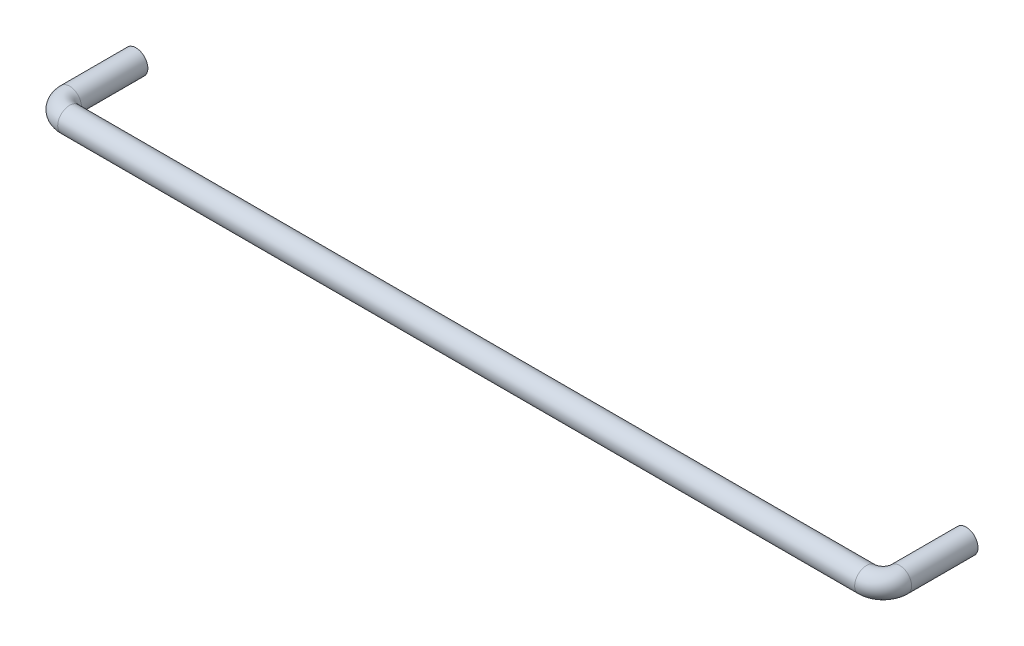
ISO-10303-21;
HEADER;
FILE_DESCRIPTION(('STEP AP214'),'2;1');
FILE_NAME('part.step','',(''),(''),'','','');
FILE_SCHEMA(('AUTOMOTIVE_DESIGN { 1 0 10303 214 1 1 1 1 }'));
ENDSEC;
DATA;
#1=APPLICATION_CONTEXT('core data for automotive mechanical design processes');
#2=APPLICATION_PROTOCOL_DEFINITION('international standard','automotive_design',2000,#1);
#3=PRODUCT_CONTEXT('',#1,'mechanical');
#4=PRODUCT('Part','Part','',(#3));
#5=PRODUCT_RELATED_PRODUCT_CATEGORY('part','',(#4));
#6=PRODUCT_DEFINITION_FORMATION('','',#4);
#7=PRODUCT_DEFINITION_CONTEXT('part definition',#1,'design');
#8=PRODUCT_DEFINITION('design','',#6,#7);
#9=PRODUCT_DEFINITION_SHAPE('','',#8);
#10=(LENGTH_UNIT() NAMED_UNIT(*) SI_UNIT(.MILLI.,.METRE.));
#11=(NAMED_UNIT(*) PLANE_ANGLE_UNIT() SI_UNIT($,.RADIAN.));
#12=(NAMED_UNIT(*) SI_UNIT($,.STERADIAN.) SOLID_ANGLE_UNIT());
#13=UNCERTAINTY_MEASURE_WITH_UNIT(LENGTH_MEASURE(1.E-05),#10,'distance_accuracy_value','');
#14=(GEOMETRIC_REPRESENTATION_CONTEXT(3) GLOBAL_UNCERTAINTY_ASSIGNED_CONTEXT((#13)) GLOBAL_UNIT_ASSIGNED_CONTEXT((#10,
#11,#12)) REPRESENTATION_CONTEXT('',''));
#15=CARTESIAN_POINT('',(0.,0.,0.));
#16=DIRECTION('',(0.,0.,1.));
#17=DIRECTION('',(1.,0.,0.));
#18=AXIS2_PLACEMENT_3D('',#15,#16,#17);
#19=CARTESIAN_POINT('',(0.,0.,0.));
#20=DIRECTION('',(0.,0.,1.));
#21=DIRECTION('',(0.,-1.,0.));
#22=AXIS2_PLACEMENT_3D('',#19,#20,#21);
#23=PLANE('',#22);
#24=CARTESIAN_POINT('',(0.,0.,0.));
#25=DIRECTION('',(0.,0.,1.));
#26=DIRECTION('',(1.,0.,0.));
#27=AXIS2_PLACEMENT_3D('',#24,#25,#26);
#28=CIRCLE('',#27,2.94999999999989);
#29=CARTESIAN_POINT('',(2.94999999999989,0.,0.));
#30=VERTEX_POINT('',#29);
#31=EDGE_CURVE('E8',#30,#30,#28,.T.);
#32=ORIENTED_EDGE('',*,*,#31,.T.);
#33=EDGE_LOOP('',(#32));
#34=FACE_BOUND('',#33,.T.);
#35=CARTESIAN_POINT('',(0.,0.,0.));
#36=DIRECTION('',(0.,0.,1.));
#37=DIRECTION('',(0.,-1.,0.));
#38=AXIS2_PLACEMENT_3D('',#35,#36,#37);
#39=CIRCLE('',#38,5.);
#40=CARTESIAN_POINT('',(0.,-5.,0.));
#41=VERTEX_POINT('',#40);
#42=EDGE_CURVE('E32',#41,#41,#39,.T.);
#43=ORIENTED_EDGE('',*,*,#42,.F.);
#44=EDGE_LOOP('',(#43));
#45=FACE_BOUND('',#44,.T.);
#46=ADVANCED_FACE('F12',(#34,#45),#23,.F.);
#47=CARTESIAN_POINT('',(350.,0.,4.9960036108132E-13));
#48=DIRECTION('',(0.,0.,-1.));
#49=DIRECTION('',(0.,-1.,0.));
#50=AXIS2_PLACEMENT_3D('',#47,#48,#49);
#51=PLANE('',#50);
#52=CARTESIAN_POINT('',(350.,0.,4.9960036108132E-13));
#53=DIRECTION('',(0.,0.,-1.));
#54=DIRECTION('',(-1.,0.,0.));
#55=AXIS2_PLACEMENT_3D('',#52,#53,#54);
#56=CIRCLE('',#55,2.94999999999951);
#57=CARTESIAN_POINT('',(347.05,0.,4.9960036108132E-13));
#58=VERTEX_POINT('',#57);
#59=EDGE_CURVE('E23',#58,#58,#56,.F.);
#60=ORIENTED_EDGE('',*,*,#59,.T.);
#61=EDGE_LOOP('',(#60));
#62=FACE_BOUND('',#61,.T.);
#63=CARTESIAN_POINT('',(350.,0.,4.9960036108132E-13));
#64=DIRECTION('',(0.,0.,-1.));
#65=DIRECTION('',(0.,-1.,0.));
#66=AXIS2_PLACEMENT_3D('',#63,#64,#65);
#67=CIRCLE('',#66,5.);
#68=CARTESIAN_POINT('',(350.,-5.,4.9960036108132E-13));
#69=VERTEX_POINT('',#68);
#70=EDGE_CURVE('E47',#69,#69,#67,.T.);
#71=ORIENTED_EDGE('',*,*,#70,.T.);
#72=EDGE_LOOP('',(#71));
#73=FACE_BOUND('',#72,.T.);
#74=ADVANCED_FACE('F75',(#62,#73),#51,.T.);
#75=CARTESIAN_POINT('',(0.,0.,28.));
#76=DIRECTION('',(0.,0.,-1.));
#77=DIRECTION('',(0.,-1.,0.));
#78=AXIS2_PLACEMENT_3D('',#75,#76,#77);
#79=CYLINDRICAL_SURFACE('',#78,5.);
#80=ORIENTED_EDGE('',*,*,#42,.T.);
#81=EDGE_LOOP('',(#80));
#82=FACE_BOUND('',#81,.T.);
#83=CARTESIAN_POINT('',(0.,0.,28.));
#84=DIRECTION('',(0.,0.,1.));
#85=DIRECTION('',(0.,-1.,0.));
#86=AXIS2_PLACEMENT_3D('',#83,#84,#85);
#87=CIRCLE('',#86,5.);
#88=CARTESIAN_POINT('',(-5.00000000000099,0.,28.));
#89=VERTEX_POINT('',#88);
#90=EDGE_CURVE('E35',#89,#89,#87,.T.);
#91=ORIENTED_EDGE('',*,*,#90,.F.);
#92=EDGE_LOOP('',(#91));
#93=FACE_BOUND('',#92,.T.);
#94=ADVANCED_FACE('F81',(#82,#93),#79,.T.);
#95=CARTESIAN_POINT('',(6.99999999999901,0.,28.));
#96=DIRECTION('',(0.,-1.,0.));
#97=DIRECTION('',(1.,0.,0.));
#98=AXIS2_PLACEMENT_3D('',#95,#96,#97);
#99=TOROIDAL_SURFACE('',#98,7.,5.);
#100=CARTESIAN_POINT('',(6.99999999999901,0.,35.));
#101=DIRECTION('',(1.,0.,0.));
#102=DIRECTION('',(0.,-1.,0.));
#103=AXIS2_PLACEMENT_3D('',#100,#101,#102);
#104=CIRCLE('',#103,5.);
#105=CARTESIAN_POINT('',(6.99999999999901,0.,40.));
#106=VERTEX_POINT('',#105);
#107=EDGE_CURVE('E38',#106,#106,#104,.T.);
#108=CARTESIAN_POINT('',(6.99999999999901,0.,28.));
#109=DIRECTION('',(0.,-1.,0.));
#110=DIRECTION('',(1.,0.,0.));
#111=AXIS2_PLACEMENT_3D('',#108,#109,#110);
#112=CIRCLE('',#111,12.);
#113=EDGE_CURVE('',#106,#89,#112,.T.);
#114=ORIENTED_EDGE('',*,*,#107,.F.);
#115=ORIENTED_EDGE('',*,*,#90,.T.);
#116=ORIENTED_EDGE('',*,*,#113,.T.);
#117=ORIENTED_EDGE('',*,*,#113,.F.);
#118=EDGE_LOOP('',(#114,#116,#115,#117));
#119=FACE_BOUND('',#118,.T.);
#120=ADVANCED_FACE('F98',(#119),#99,.T.);
#121=CARTESIAN_POINT('',(343.,0.,35.));
#122=DIRECTION('',(-1.,0.,0.));
#123=DIRECTION('',(0.,0.,1.));
#124=AXIS2_PLACEMENT_3D('',#121,#122,#123);
#125=CYLINDRICAL_SURFACE('',#124,5.);
#126=CARTESIAN_POINT('',(343.,0.,35.));
#127=DIRECTION('',(1.,0.,0.));
#128=DIRECTION('',(0.,-1.,0.));
#129=AXIS2_PLACEMENT_3D('',#126,#127,#128);
#130=CIRCLE('',#129,5.);
#131=CARTESIAN_POINT('',(343.,0.,40.));
#132=VERTEX_POINT('',#131);
#133=EDGE_CURVE('E41',#132,#132,#130,.T.);
#134=ORIENTED_EDGE('',*,*,#133,.F.);
#135=EDGE_LOOP('',(#134));
#136=FACE_BOUND('',#135,.T.);
#137=ORIENTED_EDGE('',*,*,#107,.T.);
#138=EDGE_LOOP('',(#137));
#139=FACE_BOUND('',#138,.T.);
#140=ADVANCED_FACE('F94',(#136,#139),#125,.T.);
#141=CARTESIAN_POINT('',(343.,0.,28.));
#142=DIRECTION('',(0.,-1.,0.));
#143=DIRECTION('',(1.,0.,0.));
#144=AXIS2_PLACEMENT_3D('',#141,#142,#143);
#145=TOROIDAL_SURFACE('',#144,7.,5.);
#146=CARTESIAN_POINT('',(350.,0.,28.));
#147=DIRECTION('',(0.,0.,-1.));
#148=DIRECTION('',(0.,-1.,0.));
#149=AXIS2_PLACEMENT_3D('',#146,#147,#148);
#150=CIRCLE('',#149,5.);
#151=CARTESIAN_POINT('',(355.,0.,28.));
#152=VERTEX_POINT('',#151);
#153=EDGE_CURVE('E44',#152,#152,#150,.T.);
#154=CARTESIAN_POINT('',(343.,0.,28.));
#155=DIRECTION('',(0.,-1.,0.));
#156=DIRECTION('',(1.,0.,0.));
#157=AXIS2_PLACEMENT_3D('',#154,#155,#156);
#158=CIRCLE('',#157,12.);
#159=EDGE_CURVE('',#152,#132,#158,.T.);
#160=ORIENTED_EDGE('',*,*,#153,.F.);
#161=ORIENTED_EDGE('',*,*,#133,.T.);
#162=ORIENTED_EDGE('',*,*,#159,.T.);
#163=ORIENTED_EDGE('',*,*,#159,.F.);
#164=EDGE_LOOP('',(#160,#162,#161,#163));
#165=FACE_BOUND('',#164,.T.);
#166=ADVANCED_FACE('F90',(#165),#145,.T.);
#167=CARTESIAN_POINT('',(350.,0.,28.));
#168=DIRECTION('',(0.,0.,-1.));
#169=DIRECTION('',(0.,-1.,0.));
#170=AXIS2_PLACEMENT_3D('',#167,#168,#169);
#171=CYLINDRICAL_SURFACE('',#170,5.);
#172=ORIENTED_EDGE('',*,*,#70,.F.);
#173=EDGE_LOOP('',(#172));
#174=FACE_BOUND('',#173,.T.);
#175=ORIENTED_EDGE('',*,*,#153,.T.);
#176=EDGE_LOOP('',(#175));
#177=FACE_BOUND('',#176,.T.);
#178=ADVANCED_FACE('F87',(#174,#177),#171,.T.);
#179=CARTESIAN_POINT('',(352.5,0.,10.0000000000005));
#180=DIRECTION('',(0.,0.,-1.));
#181=DIRECTION('',(0.,-1.,0.));
#182=AXIS2_PLACEMENT_3D('',#179,#180,#181);
#183=PLANE('',#182);
#184=CARTESIAN_POINT('',(350.,0.,10.0000000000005));
#185=DIRECTION('',(0.,0.,1.));
#186=DIRECTION('',(0.,1.,0.));
#187=AXIS2_PLACEMENT_3D('',#184,#185,#186);
#188=CIRCLE('',#187,2.5);
#189=CARTESIAN_POINT('',(350.,2.5,10.0000000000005));
#190=VERTEX_POINT('',#189);
#191=EDGE_CURVE('E50',#190,#190,#188,.T.);
#192=ORIENTED_EDGE('',*,*,#191,.F.);
#193=EDGE_LOOP('',(#192));
#194=FACE_BOUND('',#193,.T.);
#195=ADVANCED_FACE('F71',(#194),#183,.T.);
#196=CARTESIAN_POINT('',(350.,0.,16.0024322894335));
#197=DIRECTION('',(0.,0.,1.));
#198=DIRECTION('',(0.,1.,0.));
#199=AXIS2_PLACEMENT_3D('',#196,#197,#198);
#200=CYLINDRICAL_SURFACE('',#199,2.5);
#201=CARTESIAN_POINT('',(350.,0.,0.450000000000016));
#202=DIRECTION('',(0.,0.,-1.));
#203=DIRECTION('',(-1.,0.,0.));
#204=AXIS2_PLACEMENT_3D('',#201,#202,#203);
#205=CIRCLE('',#204,2.5);
#206=CARTESIAN_POINT('',(347.5,0.,0.450000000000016));
#207=VERTEX_POINT('',#206);
#208=EDGE_CURVE('E27',#207,#207,#205,.T.);
#209=ORIENTED_EDGE('',*,*,#208,.T.);
#210=EDGE_LOOP('',(#209));
#211=FACE_BOUND('',#210,.T.);
#212=ORIENTED_EDGE('',*,*,#191,.T.);
#213=EDGE_LOOP('',(#212));
#214=FACE_BOUND('',#213,.T.);
#215=ADVANCED_FACE('F61',(#211,#214),#200,.F.);
#216=CARTESIAN_POINT('',(2.49999999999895,0.,10.0000000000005));
#217=DIRECTION('',(0.,0.,-1.));
#218=DIRECTION('',(0.,-1.,0.));
#219=AXIS2_PLACEMENT_3D('',#216,#217,#218);
#220=PLANE('',#219);
#221=CARTESIAN_POINT('',(0.,0.,10.0000000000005));
#222=DIRECTION('',(0.,0.,1.));
#223=DIRECTION('',(0.,1.,0.));
#224=AXIS2_PLACEMENT_3D('',#221,#222,#223);
#225=CIRCLE('',#224,2.49999999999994);
#226=CARTESIAN_POINT('',(0.,2.49999999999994,10.0000000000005));
#227=VERTEX_POINT('',#226);
#228=EDGE_CURVE('E53',#227,#227,#225,.T.);
#229=ORIENTED_EDGE('',*,*,#228,.F.);
#230=EDGE_LOOP('',(#229));
#231=FACE_BOUND('',#230,.T.);
#232=ADVANCED_FACE('F59',(#231),#220,.T.);
#233=CARTESIAN_POINT('',(0.,0.,13.8623307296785));
#234=DIRECTION('',(0.,0.,1.));
#235=DIRECTION('',(0.,1.,0.));
#236=AXIS2_PLACEMENT_3D('',#233,#234,#235);
#237=CYLINDRICAL_SURFACE('',#236,2.49999999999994);
#238=CARTESIAN_POINT('',(0.,0.,0.450000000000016));
#239=DIRECTION('',(0.,0.,1.));
#240=DIRECTION('',(1.,0.,0.));
#241=AXIS2_PLACEMENT_3D('',#238,#239,#240);
#242=CIRCLE('',#241,2.49999999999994);
#243=CARTESIAN_POINT('',(2.49999999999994,0.,0.450000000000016));
#244=VERTEX_POINT('',#243);
#245=EDGE_CURVE('E19',#244,#244,#242,.F.);
#246=ORIENTED_EDGE('',*,*,#245,.T.);
#247=EDGE_LOOP('',(#246));
#248=FACE_BOUND('',#247,.T.);
#249=ORIENTED_EDGE('',*,*,#228,.T.);
#250=EDGE_LOOP('',(#249));
#251=FACE_BOUND('',#250,.T.);
#252=ADVANCED_FACE('F57',(#248,#251),#237,.F.);
#253=CARTESIAN_POINT('',(350.,0.,0.450000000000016));
#254=DIRECTION('',(0.,0.,-1.));
#255=DIRECTION('',(-1.,0.,0.));
#256=AXIS2_PLACEMENT_3D('',#253,#254,#255);
#257=CONICAL_SURFACE('',#256,2.5,0.785398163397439);
#258=ORIENTED_EDGE('',*,*,#59,.F.);
#259=EDGE_LOOP('',(#258));
#260=FACE_BOUND('',#259,.T.);
#261=ORIENTED_EDGE('',*,*,#208,.F.);
#262=EDGE_LOOP('',(#261));
#263=FACE_BOUND('',#262,.T.);
#264=ADVANCED_FACE('F69',(#260,#263),#257,.F.);
#265=CARTESIAN_POINT('',(0.,0.,0.450000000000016));
#266=DIRECTION('',(0.,0.,-1.));
#267=DIRECTION('',(-1.,0.,0.));
#268=AXIS2_PLACEMENT_3D('',#265,#266,#267);
#269=CONICAL_SURFACE('',#268,2.49999999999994,0.785398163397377);
#270=ORIENTED_EDGE('',*,*,#31,.F.);
#271=EDGE_LOOP('',(#270));
#272=FACE_BOUND('',#271,.T.);
#273=ORIENTED_EDGE('',*,*,#245,.F.);
#274=EDGE_LOOP('',(#273));
#275=FACE_BOUND('',#274,.T.);
#276=ADVANCED_FACE('F14',(#272,#275),#269,.F.);
#277=CLOSED_SHELL('',(#46,#74,#94,#120,#140,#166,#178,#195,#215,#232,#252,#264,#276));
#278=MANIFOLD_SOLID_BREP('B1',#277);
#279=ADVANCED_BREP_SHAPE_REPRESENTATION('',(#18,#278),#14);
#280=SHAPE_DEFINITION_REPRESENTATION(#9,#279);
ENDSEC;
END-ISO-10303-21;
